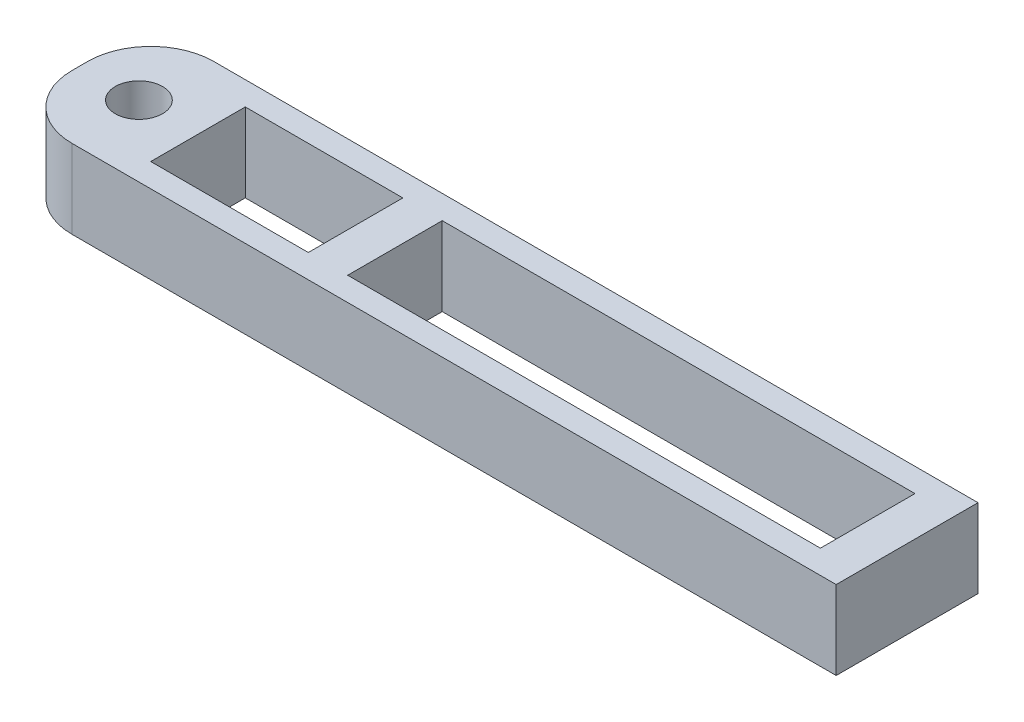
ISO-10303-21;
HEADER;
FILE_DESCRIPTION(('STEP AP214'),'2;1');
FILE_NAME('part.step','',(''),(''),'','','');
FILE_SCHEMA(('AUTOMOTIVE_DESIGN { 1 0 10303 214 1 1 1 1 }'));
ENDSEC;
DATA;
#1=APPLICATION_CONTEXT('core data for automotive mechanical design processes');
#2=APPLICATION_PROTOCOL_DEFINITION('international standard','automotive_design',2000,#1);
#3=PRODUCT_CONTEXT('',#1,'mechanical');
#4=PRODUCT('Part','Part','',(#3));
#5=PRODUCT_RELATED_PRODUCT_CATEGORY('part','',(#4));
#6=PRODUCT_DEFINITION_FORMATION('','',#4);
#7=PRODUCT_DEFINITION_CONTEXT('part definition',#1,'design');
#8=PRODUCT_DEFINITION('design','',#6,#7);
#9=PRODUCT_DEFINITION_SHAPE('','',#8);
#10=(LENGTH_UNIT() NAMED_UNIT(*) SI_UNIT(.MILLI.,.METRE.));
#11=(NAMED_UNIT(*) PLANE_ANGLE_UNIT() SI_UNIT($,.RADIAN.));
#12=(NAMED_UNIT(*) SI_UNIT($,.STERADIAN.) SOLID_ANGLE_UNIT());
#13=UNCERTAINTY_MEASURE_WITH_UNIT(LENGTH_MEASURE(1.E-05),#10,'distance_accuracy_value','');
#14=(GEOMETRIC_REPRESENTATION_CONTEXT(3) GLOBAL_UNCERTAINTY_ASSIGNED_CONTEXT((#13)) GLOBAL_UNIT_ASSIGNED_CONTEXT((#10,
#11,#12)) REPRESENTATION_CONTEXT('',''));
#15=CARTESIAN_POINT('',(0.,0.,0.));
#16=DIRECTION('',(0.,0.,1.));
#17=DIRECTION('',(1.,0.,0.));
#18=AXIS2_PLACEMENT_3D('',#15,#16,#17);
#19=CARTESIAN_POINT('',(55.,0.,-3.));
#20=DIRECTION('',(0.,0.,-1.));
#21=DIRECTION('',(0.,1.,0.));
#22=AXIS2_PLACEMENT_3D('',#19,#20,#21);
#23=PLANE('',#22);
#24=DIRECTION('',(-1.,0.,0.));
#25=VECTOR('',#24,1.);
#26=CARTESIAN_POINT('',(55.,0.,-3.));
#27=LINE('',#26,#25);
#28=CARTESIAN_POINT('',(100.,0.,-3.));
#29=VERTEX_POINT('',#28);
#30=CARTESIAN_POINT('',(40.,0.,-3.));
#31=VERTEX_POINT('',#30);
#32=EDGE_CURVE('E204',#29,#31,#27,.T.);
#33=ORIENTED_EDGE('',*,*,#32,.T.);
#34=DIRECTION('',(0.,1.,0.));
#35=VECTOR('',#34,1.);
#36=CARTESIAN_POINT('',(40.,0.,-3.));
#37=LINE('',#36,#35);
#38=CARTESIAN_POINT('',(40.,10.,-3.));
#39=VERTEX_POINT('',#38);
#40=EDGE_CURVE('E162',#31,#39,#37,.T.);
#41=ORIENTED_EDGE('',*,*,#40,.T.);
#42=DIRECTION('',(-1.,0.,0.));
#43=VECTOR('',#42,1.);
#44=CARTESIAN_POINT('',(55.,10.,-3.));
#45=LINE('',#44,#43);
#46=CARTESIAN_POINT('',(100.,10.,-3.));
#47=VERTEX_POINT('',#46);
#48=EDGE_CURVE('E155',#47,#39,#45,.T.);
#49=ORIENTED_EDGE('',*,*,#48,.F.);
#50=DIRECTION('',(0.,1.,0.));
#51=VECTOR('',#50,1.);
#52=CARTESIAN_POINT('',(100.,0.,-3.));
#53=LINE('',#52,#51);
#54=EDGE_CURVE('E179',#29,#47,#53,.T.);
#55=ORIENTED_EDGE('',*,*,#54,.F.);
#56=EDGE_LOOP('',(#33,#41,#49,#55));
#57=FACE_BOUND('',#56,.T.);
#58=ADVANCED_FACE('F39',(#57),#23,.T.);
#59=CARTESIAN_POINT('',(55.,10.,-15.));
#60=DIRECTION('',(0.,0.,-1.));
#61=DIRECTION('',(0.,1.,0.));
#62=AXIS2_PLACEMENT_3D('',#59,#60,#61);
#63=PLANE('',#62);
#64=DIRECTION('',(0.,-1.,0.));
#65=VECTOR('',#64,1.);
#66=CARTESIAN_POINT('',(40.,10.,-15.));
#67=LINE('',#66,#65);
#68=CARTESIAN_POINT('',(40.,10.,-15.));
#69=VERTEX_POINT('',#68);
#70=CARTESIAN_POINT('',(40.,0.,-15.));
#71=VERTEX_POINT('',#70);
#72=EDGE_CURVE('E143',#69,#71,#67,.T.);
#73=ORIENTED_EDGE('',*,*,#72,.T.);
#74=DIRECTION('',(-1.,0.,0.));
#75=VECTOR('',#74,1.);
#76=CARTESIAN_POINT('',(55.,0.,-15.));
#77=LINE('',#76,#75);
#78=CARTESIAN_POINT('',(100.,0.,-15.));
#79=VERTEX_POINT('',#78);
#80=EDGE_CURVE('E195',#79,#71,#77,.T.);
#81=ORIENTED_EDGE('',*,*,#80,.F.);
#82=DIRECTION('',(0.,-1.,0.));
#83=VECTOR('',#82,1.);
#84=CARTESIAN_POINT('',(100.,10.,-15.));
#85=LINE('',#84,#83);
#86=CARTESIAN_POINT('',(100.,10.,-15.));
#87=VERTEX_POINT('',#86);
#88=EDGE_CURVE('E146',#87,#79,#85,.T.);
#89=ORIENTED_EDGE('',*,*,#88,.F.);
#90=DIRECTION('',(-1.,0.,0.));
#91=VECTOR('',#90,1.);
#92=CARTESIAN_POINT('',(55.,10.,-15.));
#93=LINE('',#92,#91);
#94=EDGE_CURVE('E140',#87,#69,#93,.T.);
#95=ORIENTED_EDGE('',*,*,#94,.T.);
#96=EDGE_LOOP('',(#73,#81,#89,#95));
#97=FACE_BOUND('',#96,.T.);
#98=ADVANCED_FACE('F141',(#97),#63,.F.);
#99=CARTESIAN_POINT('',(15.,0.,0.));
#100=DIRECTION('',(-1.,0.,0.));
#101=DIRECTION('',(0.,0.,1.));
#102=AXIS2_PLACEMENT_3D('',#99,#100,#101);
#103=PLANE('',#102);
#104=DIRECTION('',(0.,-1.,0.));
#105=VECTOR('',#104,1.);
#106=CARTESIAN_POINT('',(15.,10.,-15.));
#107=LINE('',#106,#105);
#108=CARTESIAN_POINT('',(15.,10.,-15.));
#109=VERTEX_POINT('',#108);
#110=CARTESIAN_POINT('',(15.,0.,-15.));
#111=VERTEX_POINT('',#110);
#112=EDGE_CURVE('E196',#109,#111,#107,.T.);
#113=ORIENTED_EDGE('',*,*,#112,.F.);
#114=DIRECTION('',(0.,0.,1.));
#115=VECTOR('',#114,1.);
#116=CARTESIAN_POINT('',(15.,10.,0.));
#117=LINE('',#116,#115);
#118=CARTESIAN_POINT('',(15.,10.,-3.));
#119=VERTEX_POINT('',#118);
#120=EDGE_CURVE('E219',#109,#119,#117,.T.);
#121=ORIENTED_EDGE('',*,*,#120,.T.);
#122=DIRECTION('',(0.,-1.,0.));
#123=VECTOR('',#122,1.);
#124=CARTESIAN_POINT('',(15.,0.,-3.));
#125=LINE('',#124,#123);
#126=CARTESIAN_POINT('',(15.,0.,-3.));
#127=VERTEX_POINT('',#126);
#128=EDGE_CURVE('E200',#119,#127,#125,.T.);
#129=ORIENTED_EDGE('',*,*,#128,.T.);
#130=DIRECTION('',(0.,0.,-1.));
#131=VECTOR('',#130,1.);
#132=CARTESIAN_POINT('',(15.,0.,0.));
#133=LINE('',#132,#131);
#134=EDGE_CURVE('E216',#127,#111,#133,.T.);
#135=ORIENTED_EDGE('',*,*,#134,.T.);
#136=EDGE_LOOP('',(#113,#121,#129,#135));
#137=FACE_BOUND('',#136,.T.);
#138=ADVANCED_FACE('F294',(#137),#103,.F.);
#139=CARTESIAN_POINT('',(15.,0.,0.));
#140=DIRECTION('',(0.,0.,-1.));
#141=DIRECTION('',(-1.,0.,0.));
#142=AXIS2_PLACEMENT_3D('',#139,#140,#141);
#143=PLANE('',#142);
#144=DIRECTION('',(0.,-1.,0.));
#145=VECTOR('',#144,1.);
#146=CARTESIAN_POINT('',(8.,0.,0.));
#147=LINE('',#146,#145);
#148=CARTESIAN_POINT('',(8.,10.,0.));
#149=VERTEX_POINT('',#148);
#150=CARTESIAN_POINT('',(8.,0.,0.));
#151=VERTEX_POINT('',#150);
#152=EDGE_CURVE('E236',#149,#151,#147,.T.);
#153=ORIENTED_EDGE('',*,*,#152,.T.);
#154=DIRECTION('',(-1.,0.,0.));
#155=VECTOR('',#154,1.);
#156=CARTESIAN_POINT('',(15.,0.,0.));
#157=LINE('',#156,#155);
#158=CARTESIAN_POINT('',(105.,0.,0.));
#159=VERTEX_POINT('',#158);
#160=EDGE_CURVE('E234',#159,#151,#157,.T.);
#161=ORIENTED_EDGE('',*,*,#160,.F.);
#162=DIRECTION('',(0.,-1.,0.));
#163=VECTOR('',#162,1.);
#164=CARTESIAN_POINT('',(105.,10.,0.));
#165=LINE('',#164,#163);
#166=CARTESIAN_POINT('',(105.,10.,0.));
#167=VERTEX_POINT('',#166);
#168=EDGE_CURVE('E183',#167,#159,#165,.T.);
#169=ORIENTED_EDGE('',*,*,#168,.F.);
#170=DIRECTION('',(-1.,0.,0.));
#171=VECTOR('',#170,1.);
#172=CARTESIAN_POINT('',(15.,10.,0.));
#173=LINE('',#172,#171);
#174=EDGE_CURVE('E223',#167,#149,#173,.T.);
#175=ORIENTED_EDGE('',*,*,#174,.T.);
#176=EDGE_LOOP('',(#153,#161,#169,#175));
#177=FACE_BOUND('',#176,.T.);
#178=ADVANCED_FACE('F274',(#177),#143,.F.);
#179=CARTESIAN_POINT('',(15.,0.,0.));
#180=DIRECTION('',(0.,1.,0.));
#181=DIRECTION('',(0.,0.,1.));
#182=AXIS2_PLACEMENT_3D('',#179,#180,#181);
#183=PLANE('',#182);
#184=ORIENTED_EDGE('',*,*,#160,.T.);
#185=CARTESIAN_POINT('',(8.,0.,-8.));
#186=DIRECTION('',(0.,1.,0.));
#187=DIRECTION('',(0.,0.,1.));
#188=AXIS2_PLACEMENT_3D('',#185,#186,#187);
#189=CIRCLE('',#188,8.);
#190=CARTESIAN_POINT('',(0.,0.,-8.));
#191=VERTEX_POINT('',#190);
#192=EDGE_CURVE('E239',#151,#191,#189,.F.);
#193=ORIENTED_EDGE('',*,*,#192,.T.);
#194=DIRECTION('',(0.,0.,-1.));
#195=VECTOR('',#194,1.);
#196=CARTESIAN_POINT('',(0.,0.,0.));
#197=LINE('',#196,#195);
#198=CARTESIAN_POINT('',(0.,0.,-10.));
#199=VERTEX_POINT('',#198);
#200=EDGE_CURVE('E213',#191,#199,#197,.T.);
#201=ORIENTED_EDGE('',*,*,#200,.T.);
#202=CARTESIAN_POINT('',(8.,0.,-10.));
#203=DIRECTION('',(0.,1.,0.));
#204=DIRECTION('',(0.,0.,1.));
#205=AXIS2_PLACEMENT_3D('',#202,#203,#204);
#206=CIRCLE('',#205,8.);
#207=CARTESIAN_POINT('',(8.,0.,-18.));
#208=VERTEX_POINT('',#207);
#209=EDGE_CURVE('E11',#199,#208,#206,.F.);
#210=ORIENTED_EDGE('',*,*,#209,.T.);
#211=DIRECTION('',(-1.,0.,0.));
#212=VECTOR('',#211,1.);
#213=CARTESIAN_POINT('',(15.,0.,-18.));
#214=LINE('',#213,#212);
#215=CARTESIAN_POINT('',(105.,0.,-18.));
#216=VERTEX_POINT('',#215);
#217=EDGE_CURVE('E231',#216,#208,#214,.T.);
#218=ORIENTED_EDGE('',*,*,#217,.F.);
#219=DIRECTION('',(0.,0.,-1.));
#220=VECTOR('',#219,1.);
#221=CARTESIAN_POINT('',(105.,0.,0.));
#222=LINE('',#221,#220);
#223=EDGE_CURVE('E192',#159,#216,#222,.T.);
#224=ORIENTED_EDGE('',*,*,#223,.F.);
#225=EDGE_LOOP('',(#184,#193,#201,#210,#218,#224));
#226=FACE_BOUND('',#225,.T.);
#227=CARTESIAN_POINT('',(35.,0.,-3.));
#228=VERTEX_POINT('',#227);
#229=EDGE_CURVE('E203',#228,#127,#27,.T.);
#230=ORIENTED_EDGE('',*,*,#229,.F.);
#231=DIRECTION('',(0.,0.,1.));
#232=VECTOR('',#231,1.);
#233=CARTESIAN_POINT('',(35.,0.,-26.1803398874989));
#234=LINE('',#233,#232);
#235=CARTESIAN_POINT('',(35.,0.,-15.));
#236=VERTEX_POINT('',#235);
#237=EDGE_CURVE('E168',#236,#228,#234,.T.);
#238=ORIENTED_EDGE('',*,*,#237,.F.);
#239=EDGE_CURVE('E149',#236,#111,#77,.T.);
#240=ORIENTED_EDGE('',*,*,#239,.T.);
#241=ORIENTED_EDGE('',*,*,#134,.F.);
#242=EDGE_LOOP('',(#230,#238,#240,#241));
#243=FACE_BOUND('',#242,.T.);
#244=CARTESIAN_POINT('',(7.5,0.,-9.));
#245=DIRECTION('',(0.,1.,0.));
#246=DIRECTION('',(0.,0.,1.));
#247=AXIS2_PLACEMENT_3D('',#244,#245,#246);
#248=CIRCLE('',#247,3.);
#249=CARTESIAN_POINT('',(7.5,0.,-6.));
#250=VERTEX_POINT('',#249);
#251=EDGE_CURVE('E210',#250,#250,#248,.T.);
#252=ORIENTED_EDGE('',*,*,#251,.T.);
#253=EDGE_LOOP('',(#252));
#254=FACE_BOUND('',#253,.T.);
#255=DIRECTION('',(0.,0.,1.));
#256=VECTOR('',#255,1.);
#257=CARTESIAN_POINT('',(40.,0.,-26.1803398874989));
#258=LINE('',#257,#256);
#259=EDGE_CURVE('E161',#71,#31,#258,.T.);
#260=ORIENTED_EDGE('',*,*,#259,.T.);
#261=ORIENTED_EDGE('',*,*,#32,.F.);
#262=DIRECTION('',(0.,0.,1.));
#263=VECTOR('',#262,1.);
#264=CARTESIAN_POINT('',(100.,0.,-26.1803398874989));
#265=LINE('',#264,#263);
#266=EDGE_CURVE('E176',#79,#29,#265,.T.);
#267=ORIENTED_EDGE('',*,*,#266,.F.);
#268=ORIENTED_EDGE('',*,*,#80,.T.);
#269=EDGE_LOOP('',(#260,#261,#267,#268));
#270=FACE_BOUND('',#269,.T.);
#271=ADVANCED_FACE('F260',(#226,#243,#254,#270),#183,.F.);
#272=CARTESIAN_POINT('',(15.,0.,-18.));
#273=DIRECTION('',(0.,0.,1.));
#274=DIRECTION('',(1.,0.,0.));
#275=AXIS2_PLACEMENT_3D('',#272,#273,#274);
#276=PLANE('',#275);
#277=ORIENTED_EDGE('',*,*,#217,.T.);
#278=DIRECTION('',(0.,1.,0.));
#279=VECTOR('',#278,1.);
#280=CARTESIAN_POINT('',(8.,10.,-18.));
#281=LINE('',#280,#279);
#282=CARTESIAN_POINT('',(8.,10.,-18.));
#283=VERTEX_POINT('',#282);
#284=EDGE_CURVE('E247',#208,#283,#281,.T.);
#285=ORIENTED_EDGE('',*,*,#284,.T.);
#286=DIRECTION('',(-1.,0.,0.));
#287=VECTOR('',#286,1.);
#288=CARTESIAN_POINT('',(15.,10.,-18.));
#289=LINE('',#288,#287);
#290=CARTESIAN_POINT('',(105.,10.,-18.));
#291=VERTEX_POINT('',#290);
#292=EDGE_CURVE('E228',#291,#283,#289,.T.);
#293=ORIENTED_EDGE('',*,*,#292,.F.);
#294=DIRECTION('',(0.,-1.,0.));
#295=VECTOR('',#294,1.);
#296=CARTESIAN_POINT('',(105.,0.,-18.));
#297=LINE('',#296,#295);
#298=EDGE_CURVE('E186',#291,#216,#297,.T.);
#299=ORIENTED_EDGE('',*,*,#298,.T.);
#300=EDGE_LOOP('',(#277,#285,#293,#299));
#301=FACE_BOUND('',#300,.T.);
#302=ADVANCED_FACE('F265',(#301),#276,.F.);
#303=CARTESIAN_POINT('',(15.,10.,0.));
#304=DIRECTION('',(0.,-1.,0.));
#305=DIRECTION('',(0.,0.,-1.));
#306=AXIS2_PLACEMENT_3D('',#303,#304,#305);
#307=PLANE('',#306);
#308=DIRECTION('',(0.,0.,1.));
#309=VECTOR('',#308,1.);
#310=CARTESIAN_POINT('',(35.,10.,-26.1803398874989));
#311=LINE('',#310,#309);
#312=CARTESIAN_POINT('',(35.,10.,-15.));
#313=VERTEX_POINT('',#312);
#314=CARTESIAN_POINT('',(35.,10.,-3.));
#315=VERTEX_POINT('',#314);
#316=EDGE_CURVE('E156',#313,#315,#311,.T.);
#317=ORIENTED_EDGE('',*,*,#316,.T.);
#318=EDGE_CURVE('E207',#315,#119,#45,.T.);
#319=ORIENTED_EDGE('',*,*,#318,.T.);
#320=ORIENTED_EDGE('',*,*,#120,.F.);
#321=EDGE_CURVE('E150',#313,#109,#93,.T.);
#322=ORIENTED_EDGE('',*,*,#321,.F.);
#323=EDGE_LOOP('',(#317,#319,#320,#322));
#324=FACE_BOUND('',#323,.T.);
#325=ORIENTED_EDGE('',*,*,#48,.T.);
#326=DIRECTION('',(0.,0.,1.));
#327=VECTOR('',#326,1.);
#328=CARTESIAN_POINT('',(40.,10.,-26.1803398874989));
#329=LINE('',#328,#327);
#330=EDGE_CURVE('E54',#69,#39,#329,.T.);
#331=ORIENTED_EDGE('',*,*,#330,.F.);
#332=ORIENTED_EDGE('',*,*,#94,.F.);
#333=DIRECTION('',(0.,0.,1.));
#334=VECTOR('',#333,1.);
#335=CARTESIAN_POINT('',(100.,10.,-26.1803398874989));
#336=LINE('',#335,#334);
#337=EDGE_CURVE('E174',#87,#47,#336,.T.);
#338=ORIENTED_EDGE('',*,*,#337,.T.);
#339=EDGE_LOOP('',(#325,#331,#332,#338));
#340=FACE_BOUND('',#339,.T.);
#341=CARTESIAN_POINT('',(7.5,10.,-9.));
#342=DIRECTION('',(0.,1.,0.));
#343=DIRECTION('',(0.,0.,1.));
#344=AXIS2_PLACEMENT_3D('',#341,#342,#343);
#345=CIRCLE('',#344,3.);
#346=CARTESIAN_POINT('',(7.5,10.,-6.));
#347=VERTEX_POINT('',#346);
#348=EDGE_CURVE('E209',#347,#347,#345,.T.);
#349=ORIENTED_EDGE('',*,*,#348,.F.);
#350=EDGE_LOOP('',(#349));
#351=FACE_BOUND('',#350,.T.);
#352=CARTESIAN_POINT('',(8.,10.,-8.));
#353=DIRECTION('',(0.,-1.,0.));
#354=DIRECTION('',(0.,0.,-1.));
#355=AXIS2_PLACEMENT_3D('',#352,#353,#354);
#356=CIRCLE('',#355,8.);
#357=CARTESIAN_POINT('',(0.,10.,-8.));
#358=VERTEX_POINT('',#357);
#359=EDGE_CURVE('E244',#358,#149,#356,.F.);
#360=ORIENTED_EDGE('',*,*,#359,.T.);
#361=ORIENTED_EDGE('',*,*,#174,.F.);
#362=DIRECTION('',(0.,0.,-1.));
#363=VECTOR('',#362,1.);
#364=CARTESIAN_POINT('',(105.,10.,0.));
#365=LINE('',#364,#363);
#366=EDGE_CURVE('E189',#167,#291,#365,.T.);
#367=ORIENTED_EDGE('',*,*,#366,.T.);
#368=ORIENTED_EDGE('',*,*,#292,.T.);
#369=CARTESIAN_POINT('',(8.,10.,-10.));
#370=DIRECTION('',(0.,-1.,0.));
#371=DIRECTION('',(0.,0.,-1.));
#372=AXIS2_PLACEMENT_3D('',#369,#370,#371);
#373=CIRCLE('',#372,8.);
#374=CARTESIAN_POINT('',(0.,10.,-10.));
#375=VERTEX_POINT('',#374);
#376=EDGE_CURVE('E250',#283,#375,#373,.F.);
#377=ORIENTED_EDGE('',*,*,#376,.T.);
#378=DIRECTION('',(0.,0.,1.));
#379=VECTOR('',#378,1.);
#380=CARTESIAN_POINT('',(0.,10.,0.));
#381=LINE('',#380,#379);
#382=EDGE_CURVE('E220',#375,#358,#381,.T.);
#383=ORIENTED_EDGE('',*,*,#382,.T.);
#384=EDGE_LOOP('',(#360,#361,#367,#368,#377,#383));
#385=FACE_BOUND('',#384,.T.);
#386=ADVANCED_FACE('F153',(#324,#340,#351,#385),#307,.F.);
#387=CARTESIAN_POINT('',(0.,0.,0.));
#388=DIRECTION('',(-1.,0.,0.));
#389=DIRECTION('',(0.,0.,1.));
#390=AXIS2_PLACEMENT_3D('',#387,#388,#389);
#391=PLANE('',#390);
#392=ORIENTED_EDGE('',*,*,#382,.F.);
#393=DIRECTION('',(0.,1.,0.));
#394=VECTOR('',#393,1.);
#395=CARTESIAN_POINT('',(0.,0.,-10.));
#396=LINE('',#395,#394);
#397=EDGE_CURVE('E47',#375,#199,#396,.F.);
#398=ORIENTED_EDGE('',*,*,#397,.T.);
#399=ORIENTED_EDGE('',*,*,#200,.F.);
#400=DIRECTION('',(0.,-1.,0.));
#401=VECTOR('',#400,1.);
#402=CARTESIAN_POINT('',(0.,10.,-8.));
#403=LINE('',#402,#401);
#404=EDGE_CURVE('E241',#191,#358,#403,.F.);
#405=ORIENTED_EDGE('',*,*,#404,.T.);
#406=EDGE_LOOP('',(#392,#398,#399,#405));
#407=FACE_BOUND('',#406,.T.);
#408=ADVANCED_FACE('F255',(#407),#391,.T.);
#409=CARTESIAN_POINT('',(7.5,0.,-9.));
#410=DIRECTION('',(0.,1.,0.));
#411=DIRECTION('',(0.,0.,1.));
#412=AXIS2_PLACEMENT_3D('',#409,#410,#411);
#413=CYLINDRICAL_SURFACE('',#412,3.);
#414=ORIENTED_EDGE('',*,*,#251,.F.);
#415=EDGE_LOOP('',(#414));
#416=FACE_BOUND('',#415,.T.);
#417=ORIENTED_EDGE('',*,*,#348,.T.);
#418=EDGE_LOOP('',(#417));
#419=FACE_BOUND('',#418,.T.);
#420=ADVANCED_FACE('F297',(#416,#419),#413,.F.);
#421=DIRECTION('',(0.,1.,0.));
#422=VECTOR('',#421,1.);
#423=CARTESIAN_POINT('',(35.,0.,-3.));
#424=LINE('',#423,#422);
#425=EDGE_CURVE('E164',#228,#315,#424,.T.);
#426=ORIENTED_EDGE('',*,*,#425,.F.);
#427=ORIENTED_EDGE('',*,*,#229,.T.);
#428=ORIENTED_EDGE('',*,*,#128,.F.);
#429=ORIENTED_EDGE('',*,*,#318,.F.);
#430=EDGE_LOOP('',(#426,#427,#428,#429));
#431=FACE_BOUND('',#430,.T.);
#432=ADVANCED_FACE('F285',(#431),#23,.T.);
#433=ORIENTED_EDGE('',*,*,#239,.F.);
#434=DIRECTION('',(0.,-1.,0.));
#435=VECTOR('',#434,1.);
#436=CARTESIAN_POINT('',(35.,10.,-15.));
#437=LINE('',#436,#435);
#438=EDGE_CURVE('E62',#313,#236,#437,.T.);
#439=ORIENTED_EDGE('',*,*,#438,.F.);
#440=ORIENTED_EDGE('',*,*,#321,.T.);
#441=ORIENTED_EDGE('',*,*,#112,.T.);
#442=EDGE_LOOP('',(#433,#439,#440,#441));
#443=FACE_BOUND('',#442,.T.);
#444=ADVANCED_FACE('F280',(#443),#63,.F.);
#445=CARTESIAN_POINT('',(8.,0.,-8.));
#446=DIRECTION('',(0.,1.,0.));
#447=DIRECTION('',(0.,0.,1.));
#448=AXIS2_PLACEMENT_3D('',#445,#446,#447);
#449=CYLINDRICAL_SURFACE('',#448,8.);
#450=ORIENTED_EDGE('',*,*,#359,.F.);
#451=ORIENTED_EDGE('',*,*,#404,.F.);
#452=ORIENTED_EDGE('',*,*,#192,.F.);
#453=ORIENTED_EDGE('',*,*,#152,.F.);
#454=EDGE_LOOP('',(#450,#451,#452,#453));
#455=FACE_BOUND('',#454,.T.);
#456=ADVANCED_FACE('F278',(#455),#449,.T.);
#457=CARTESIAN_POINT('',(8.,0.,-10.));
#458=DIRECTION('',(0.,-1.,0.));
#459=DIRECTION('',(0.,0.,-1.));
#460=AXIS2_PLACEMENT_3D('',#457,#458,#459);
#461=CYLINDRICAL_SURFACE('',#460,8.);
#462=ORIENTED_EDGE('',*,*,#209,.F.);
#463=ORIENTED_EDGE('',*,*,#397,.F.);
#464=ORIENTED_EDGE('',*,*,#376,.F.);
#465=ORIENTED_EDGE('',*,*,#284,.F.);
#466=EDGE_LOOP('',(#462,#463,#464,#465));
#467=FACE_BOUND('',#466,.T.);
#468=ADVANCED_FACE('F41',(#467),#461,.T.);
#469=CARTESIAN_POINT('',(105.,0.,0.));
#470=DIRECTION('',(1.,0.,0.));
#471=DIRECTION('',(0.,0.,-1.));
#472=AXIS2_PLACEMENT_3D('',#469,#470,#471);
#473=PLANE('',#472);
#474=ORIENTED_EDGE('',*,*,#298,.F.);
#475=ORIENTED_EDGE('',*,*,#366,.F.);
#476=ORIENTED_EDGE('',*,*,#168,.T.);
#477=ORIENTED_EDGE('',*,*,#223,.T.);
#478=EDGE_LOOP('',(#474,#475,#476,#477));
#479=FACE_BOUND('',#478,.T.);
#480=ADVANCED_FACE('F271',(#479),#473,.T.);
#481=CARTESIAN_POINT('',(100.,10.,-26.1803398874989));
#482=DIRECTION('',(-1.,0.,0.));
#483=DIRECTION('',(0.,0.,1.));
#484=AXIS2_PLACEMENT_3D('',#481,#482,#483);
#485=PLANE('',#484);
#486=ORIENTED_EDGE('',*,*,#266,.T.);
#487=ORIENTED_EDGE('',*,*,#54,.T.);
#488=ORIENTED_EDGE('',*,*,#337,.F.);
#489=ORIENTED_EDGE('',*,*,#88,.T.);
#490=EDGE_LOOP('',(#486,#487,#488,#489));
#491=FACE_BOUND('',#490,.T.);
#492=ADVANCED_FACE('F318',(#491),#485,.T.);
#493=CARTESIAN_POINT('',(35.,10.,-26.1803398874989));
#494=DIRECTION('',(-1.,0.,0.));
#495=DIRECTION('',(0.,0.,1.));
#496=AXIS2_PLACEMENT_3D('',#493,#494,#495);
#497=PLANE('',#496);
#498=ORIENTED_EDGE('',*,*,#237,.T.);
#499=ORIENTED_EDGE('',*,*,#425,.T.);
#500=ORIENTED_EDGE('',*,*,#316,.F.);
#501=ORIENTED_EDGE('',*,*,#438,.T.);
#502=EDGE_LOOP('',(#498,#499,#500,#501));
#503=FACE_BOUND('',#502,.T.);
#504=ADVANCED_FACE('F316',(#503),#497,.T.);
#505=CARTESIAN_POINT('',(40.,10.,-26.1803398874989));
#506=DIRECTION('',(-1.,0.,0.));
#507=DIRECTION('',(0.,-1.,0.));
#508=AXIS2_PLACEMENT_3D('',#505,#506,#507);
#509=PLANE('',#508);
#510=ORIENTED_EDGE('',*,*,#40,.F.);
#511=ORIENTED_EDGE('',*,*,#259,.F.);
#512=ORIENTED_EDGE('',*,*,#72,.F.);
#513=ORIENTED_EDGE('',*,*,#330,.T.);
#514=EDGE_LOOP('',(#510,#511,#512,#513));
#515=FACE_BOUND('',#514,.T.);
#516=ADVANCED_FACE('F159',(#515),#509,.F.);
#517=CLOSED_SHELL('',(#58,#98,#138,#178,#271,#302,#386,#408,#420,#432,#444,#456,#468,#480,#492,
#504,#516));
#518=MANIFOLD_SOLID_BREP('B2',#517);
#519=ADVANCED_BREP_SHAPE_REPRESENTATION('',(#18,#518),#14);
#520=SHAPE_DEFINITION_REPRESENTATION(#9,#519);
ENDSEC;
END-ISO-10303-21;
